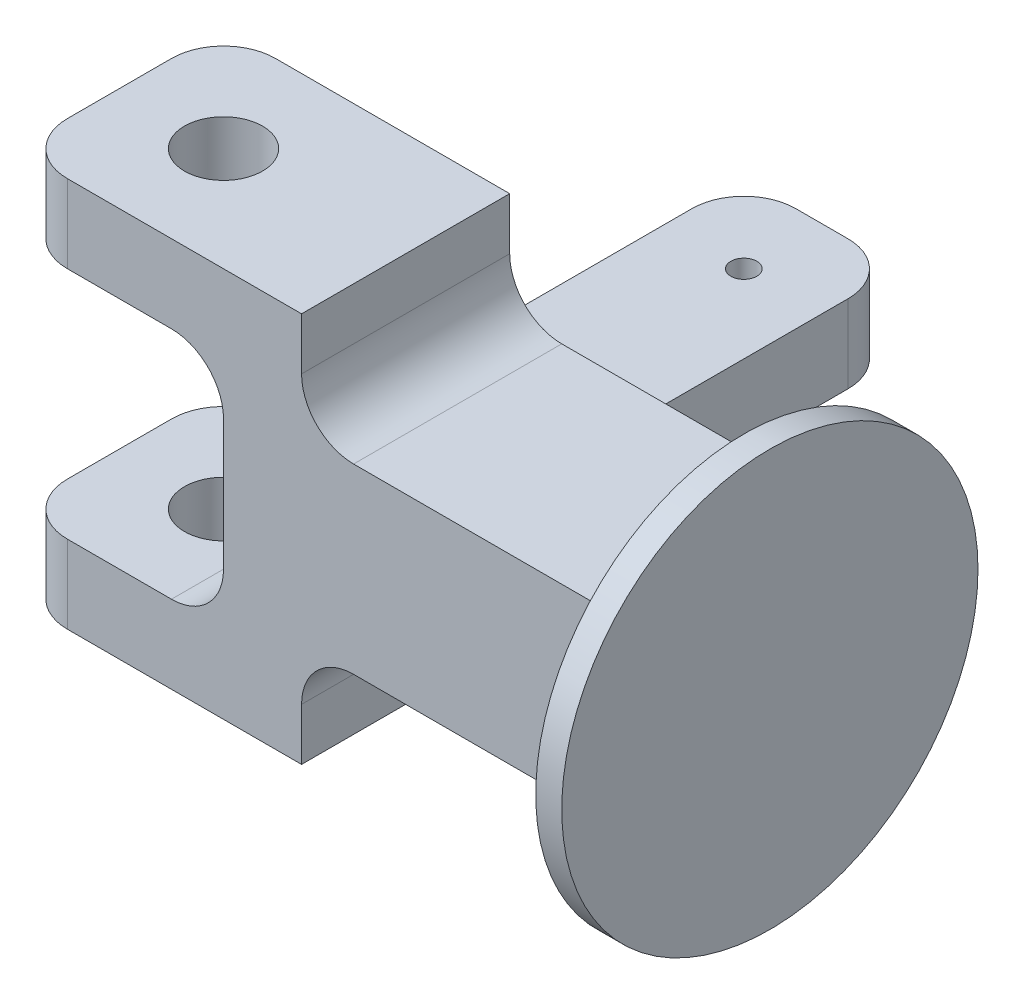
from build123d import *

# Parameters (mm, degrees)
SKETCH1_R           = 3.175
SKETCH1_R_2         = 9.525
BOSS_EXTRUDE1_DEPTH = 47.625
CUT_EXTRUDE1_DEPTH  = 151.436043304
CUT_EXTRUDE2_DEPTH  = 143.875
CUT_EXTRUDE3_DEPTH  = 114.813896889
SKETCH7_R           = 50.8
BOSS_EXTRUDE2_DEPTH = 6.35


with BuildPart() as part:
    # Sketch1 → Boss-Extrude1 (new, symmetric)
    with BuildSketch(Plane(origin=(0, 0, 0), x_dir=(1, 0, 0), z_dir=(0, 1, 0))):
        with BuildLine():
            Line((-63.5, -25.4), (76.2, -25.4))
            Line((76.2, -25.4), (76.2, 25.4))
            Line((76.2, 25.4), (19.05, 25.4))
            Line((19.05, 25.4), (19.05, 82.55))
            ThreePointArc((19.05, 82.55), (15.330256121, 91.530256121), (6.35, 95.25))
            Line((6.35, 95.25), (-6.35, 95.25))
            ThreePointArc((-6.35, 95.25), (-15.330256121, 91.530256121), (-19.05, 82.55))
            Line((-19.05, 82.55), (-19.05, 25.4))
            Line((-19.05, 25.4), (-63.5, 25.4))
            ThreePointArc((-63.5, 25.4), (-72.480256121, 21.680256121), (-76.2, 12.7))
            Line((-76.2, 12.7), (-76.2, -12.7))
            ThreePointArc((-76.2, -12.7), (-72.480256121, -21.680256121), (-63.5, -25.4))
        make_face()
        with Locations(Location((0, 76.2, 0), (0, 0, 270))):
            Circle(SKETCH1_R, mode=Mode.SUBTRACT)
        with Locations(Location((-50.8, 0, 0), (0, 0, 270))):
            Circle(SKETCH1_R_2, mode=Mode.SUBTRACT)
    extrude(amount=BOSS_EXTRUDE1_DEPTH, both=True)

    # Sketch2 → Cut-Extrude1 (cut, through all)
    with BuildSketch(Plane.XY.offset(25.4)):
        with BuildLine():
            Line((-76.2, 28.575), (-38.1, 28.575))
            ThreePointArc((-38.1, 28.575), (-29.119743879, 24.855256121), (-25.4, 15.875))
            Line((-25.4, 15.875), (-25.4, -15.875))
            ThreePointArc((-25.4, -15.875), (-29.119743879, -24.855256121), (-38.1, -28.575))
            Line((-38.1, -28.575), (-76.2, -28.575))
            Line((-76.2, -28.575), (-76.2, 28.575))
        make_face()
    extrude(amount=-CUT_EXTRUDE1_DEPTH, mode=Mode.SUBTRACT)

    # Sketch5 → Cut-Extrude2 (cut, through all)
    with BuildSketch(Plane.ZY.offset(19.05)):
        with BuildLine():
            Line((-95.25, 47.625), (-25.4, 47.625))
            Line((-25.4, 47.625), (-25.4, 22.225))
            ThreePointArc((-25.4, 22.225), (-29.119743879, 13.244743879), (-38.1, 9.525))
            Line((-38.1, 9.525), (-95.25, 9.525))
            Line((-95.25, 9.525), (-95.25, 47.625))
        make_face()
        with BuildLine():
            Line((-38.1, -9.525), (-95.25, -9.525))
            Line((-95.25, -9.525), (-95.25, -47.625))
            Line((-95.25, -47.625), (-25.4, -47.625))
            Line((-25.4, -47.625), (-25.4, -22.225))
            ThreePointArc((-25.4, -22.225), (-29.119743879, -13.244743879), (-38.1, -9.525))
        make_face()
    extrude(amount=-CUT_EXTRUDE2_DEPTH, mode=Mode.SUBTRACT)

    # Sketch6 → Cut-Extrude3 (cut, through all)
    with BuildSketch(Plane(origin=(0, 0, -25.4), x_dir=(-1, 0, 0), z_dir=(0, 0, -1))):
        with BuildLine():
            Line((-76.2, 22.225), (-6.35, 22.225))
            ThreePointArc((-6.35, 22.225), (2.630256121, 25.944743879), (6.35, 34.925))
            Line((6.35, 34.925), (6.35, 47.625))
            Line((6.35, 47.625), (-76.2, 47.625))
            Line((-76.2, 47.625), (-76.2, 22.225))
        make_face()
    cut_extrude3 = extrude(amount=-CUT_EXTRUDE3_DEPTH, mode=Mode.SUBTRACT)

    # Mirror1: Cut-Extrude3 across plane
    add(cut_extrude3.mirror(Plane.ZX), mode=Mode.SUBTRACT)

    # Sketch7 → Boss-Extrude2 (add)
    with BuildSketch(Plane(origin=(76.2, 0, 0), x_dir=(0, 0, -1), z_dir=(1, 0, 0))):
        Circle(SKETCH7_R)
    extrude(amount=BOSS_EXTRUDE2_DEPTH)


solid = part.part
